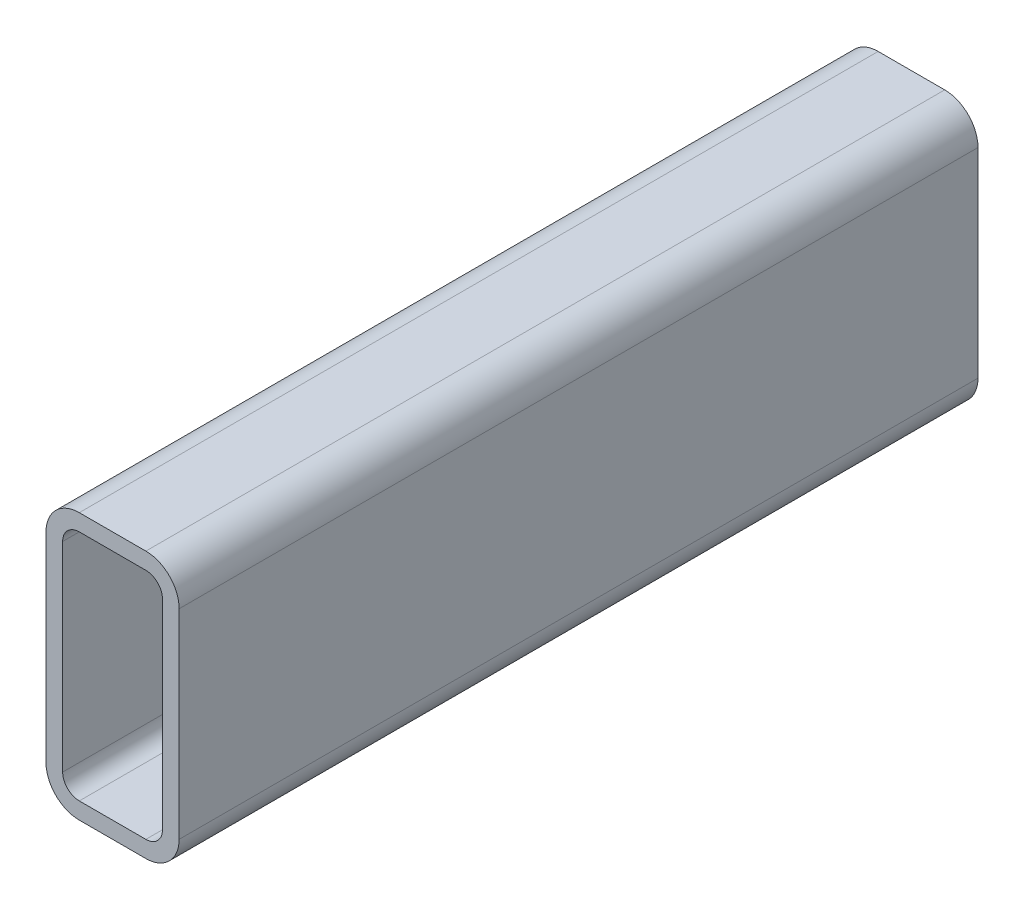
ISO-10303-21;
HEADER;
FILE_DESCRIPTION(('STEP AP214'),'2;1');
FILE_NAME('part.step','',(''),(''),'','','');
FILE_SCHEMA(('AUTOMOTIVE_DESIGN { 1 0 10303 214 1 1 1 1 }'));
ENDSEC;
DATA;
#1=APPLICATION_CONTEXT('core data for automotive mechanical design processes');
#2=APPLICATION_PROTOCOL_DEFINITION('international standard','automotive_design',2000,#1);
#3=PRODUCT_CONTEXT('',#1,'mechanical');
#4=PRODUCT('Part','Part','',(#3));
#5=PRODUCT_RELATED_PRODUCT_CATEGORY('part','',(#4));
#6=PRODUCT_DEFINITION_FORMATION('','',#4);
#7=PRODUCT_DEFINITION_CONTEXT('part definition',#1,'design');
#8=PRODUCT_DEFINITION('design','',#6,#7);
#9=PRODUCT_DEFINITION_SHAPE('','',#8);
#10=(LENGTH_UNIT() NAMED_UNIT(*) SI_UNIT(.MILLI.,.METRE.));
#11=(NAMED_UNIT(*) PLANE_ANGLE_UNIT() SI_UNIT($,.RADIAN.));
#12=(NAMED_UNIT(*) SI_UNIT($,.STERADIAN.) SOLID_ANGLE_UNIT());
#13=UNCERTAINTY_MEASURE_WITH_UNIT(LENGTH_MEASURE(1.E-05),#10,'distance_accuracy_value','');
#14=(GEOMETRIC_REPRESENTATION_CONTEXT(3) GLOBAL_UNCERTAINTY_ASSIGNED_CONTEXT((#13)) GLOBAL_UNIT_ASSIGNED_CONTEXT((#10,
#11,#12)) REPRESENTATION_CONTEXT('',''));
#15=CARTESIAN_POINT('',(0.,0.,0.));
#16=DIRECTION('',(0.,0.,1.));
#17=DIRECTION('',(1.,0.,0.));
#18=AXIS2_PLACEMENT_3D('',#15,#16,#17);
#19=CARTESIAN_POINT('',(12.7,88.9,304.8));
#20=DIRECTION('',(0.,0.,1.));
#21=DIRECTION('',(1.,0.,0.));
#22=AXIS2_PLACEMENT_3D('',#19,#20,#21);
#23=PLANE('',#22);
#24=CARTESIAN_POINT('',(12.7,88.9,304.8));
#25=DIRECTION('',(0.,0.,1.));
#26=DIRECTION('',(1.,0.,0.));
#27=AXIS2_PLACEMENT_3D('',#24,#25,#26);
#28=CIRCLE('',#27,12.7);
#29=CARTESIAN_POINT('',(12.7,101.6,304.8));
#30=VERTEX_POINT('',#29);
#31=CARTESIAN_POINT('',(0.,88.9,304.8));
#32=VERTEX_POINT('',#31);
#33=EDGE_CURVE('E211',#30,#32,#28,.T.);
#34=ORIENTED_EDGE('',*,*,#33,.T.);
#35=DIRECTION('',(0.,-1.,0.));
#36=VECTOR('',#35,1.);
#37=CARTESIAN_POINT('',(0.,12.7,304.8));
#38=LINE('',#37,#36);
#39=CARTESIAN_POINT('',(0.,12.7,304.8));
#40=VERTEX_POINT('',#39);
#41=EDGE_CURVE('E214',#32,#40,#38,.T.);
#42=ORIENTED_EDGE('',*,*,#41,.T.);
#43=CARTESIAN_POINT('',(12.7,12.7,304.8));
#44=DIRECTION('',(0.,0.,1.));
#45=DIRECTION('',(1.,0.,0.));
#46=AXIS2_PLACEMENT_3D('',#43,#44,#45);
#47=CIRCLE('',#46,12.7);
#48=CARTESIAN_POINT('',(12.7,0.,304.8));
#49=VERTEX_POINT('',#48);
#50=EDGE_CURVE('E217',#40,#49,#47,.T.);
#51=ORIENTED_EDGE('',*,*,#50,.T.);
#52=DIRECTION('',(1.,0.,0.));
#53=VECTOR('',#52,1.);
#54=CARTESIAN_POINT('',(38.1,0.,304.8));
#55=LINE('',#54,#53);
#56=CARTESIAN_POINT('',(38.1,0.,304.8));
#57=VERTEX_POINT('',#56);
#58=EDGE_CURVE('E219',#49,#57,#55,.T.);
#59=ORIENTED_EDGE('',*,*,#58,.T.);
#60=CARTESIAN_POINT('',(38.1,12.7,304.8));
#61=DIRECTION('',(0.,0.,1.));
#62=DIRECTION('',(1.,0.,0.));
#63=AXIS2_PLACEMENT_3D('',#60,#61,#62);
#64=CIRCLE('',#63,12.7);
#65=CARTESIAN_POINT('',(50.8,12.7,304.8));
#66=VERTEX_POINT('',#65);
#67=EDGE_CURVE('E221',#57,#66,#64,.T.);
#68=ORIENTED_EDGE('',*,*,#67,.T.);
#69=DIRECTION('',(0.,1.,0.));
#70=VECTOR('',#69,1.);
#71=CARTESIAN_POINT('',(50.8,88.9,304.8));
#72=LINE('',#71,#70);
#73=CARTESIAN_POINT('',(50.8,88.9,304.8));
#74=VERTEX_POINT('',#73);
#75=EDGE_CURVE('E223',#66,#74,#72,.T.);
#76=ORIENTED_EDGE('',*,*,#75,.T.);
#77=CARTESIAN_POINT('',(38.1,88.9,304.8));
#78=DIRECTION('',(0.,0.,1.));
#79=DIRECTION('',(1.,0.,0.));
#80=AXIS2_PLACEMENT_3D('',#77,#78,#79);
#81=CIRCLE('',#80,12.7);
#82=CARTESIAN_POINT('',(38.1,101.6,304.8));
#83=VERTEX_POINT('',#82);
#84=EDGE_CURVE('E225',#74,#83,#81,.T.);
#85=ORIENTED_EDGE('',*,*,#84,.T.);
#86=DIRECTION('',(-1.,0.,0.));
#87=VECTOR('',#86,1.);
#88=CARTESIAN_POINT('',(12.7,101.6,304.8));
#89=LINE('',#88,#87);
#90=EDGE_CURVE('E227',#83,#30,#89,.T.);
#91=ORIENTED_EDGE('',*,*,#90,.T.);
#92=EDGE_LOOP('',(#34,#42,#51,#59,#68,#76,#85,#91));
#93=FACE_BOUND('',#92,.T.);
#94=DIRECTION('',(0.,-1.,0.));
#95=VECTOR('',#94,1.);
#96=CARTESIAN_POINT('',(6.35,12.7,304.8));
#97=LINE('',#96,#95);
#98=CARTESIAN_POINT('',(6.35,88.9,304.8));
#99=VERTEX_POINT('',#98);
#100=CARTESIAN_POINT('',(6.35,12.7,304.8));
#101=VERTEX_POINT('',#100);
#102=EDGE_CURVE('E154',#99,#101,#97,.T.);
#103=ORIENTED_EDGE('',*,*,#102,.F.);
#104=CARTESIAN_POINT('',(12.7,88.9,304.8));
#105=DIRECTION('',(0.,0.,1.));
#106=DIRECTION('',(1.,0.,0.));
#107=AXIS2_PLACEMENT_3D('',#104,#105,#106);
#108=CIRCLE('',#107,6.35);
#109=CARTESIAN_POINT('',(12.7,95.25,304.8));
#110=VERTEX_POINT('',#109);
#111=EDGE_CURVE('E146',#110,#99,#108,.T.);
#112=ORIENTED_EDGE('',*,*,#111,.F.);
#113=DIRECTION('',(-1.,0.,0.));
#114=VECTOR('',#113,1.);
#115=CARTESIAN_POINT('',(12.7,95.25,304.8));
#116=LINE('',#115,#114);
#117=CARTESIAN_POINT('',(38.1,95.25,304.8));
#118=VERTEX_POINT('',#117);
#119=EDGE_CURVE('E179',#118,#110,#116,.T.);
#120=ORIENTED_EDGE('',*,*,#119,.F.);
#121=CARTESIAN_POINT('',(38.1,88.9,304.8));
#122=DIRECTION('',(0.,0.,1.));
#123=DIRECTION('',(1.,0.,0.));
#124=AXIS2_PLACEMENT_3D('',#121,#122,#123);
#125=CIRCLE('',#124,6.35);
#126=CARTESIAN_POINT('',(44.45,88.9,304.8));
#127=VERTEX_POINT('',#126);
#128=EDGE_CURVE('E177',#127,#118,#125,.T.);
#129=ORIENTED_EDGE('',*,*,#128,.F.);
#130=DIRECTION('',(0.,1.,0.));
#131=VECTOR('',#130,1.);
#132=CARTESIAN_POINT('',(44.45,88.9,304.8));
#133=LINE('',#132,#131);
#134=CARTESIAN_POINT('',(44.45,12.7,304.8));
#135=VERTEX_POINT('',#134);
#136=EDGE_CURVE('E175',#135,#127,#133,.T.);
#137=ORIENTED_EDGE('',*,*,#136,.F.);
#138=CARTESIAN_POINT('',(38.1,12.7,304.8));
#139=DIRECTION('',(0.,0.,1.));
#140=DIRECTION('',(1.,0.,0.));
#141=AXIS2_PLACEMENT_3D('',#138,#139,#140);
#142=CIRCLE('',#141,6.35);
#143=CARTESIAN_POINT('',(38.1,6.35,304.8));
#144=VERTEX_POINT('',#143);
#145=EDGE_CURVE('E173',#144,#135,#142,.T.);
#146=ORIENTED_EDGE('',*,*,#145,.F.);
#147=DIRECTION('',(1.,0.,0.));
#148=VECTOR('',#147,1.);
#149=CARTESIAN_POINT('',(38.1,6.35,304.8));
#150=LINE('',#149,#148);
#151=CARTESIAN_POINT('',(12.7,6.35,304.8));
#152=VERTEX_POINT('',#151);
#153=EDGE_CURVE('E169',#152,#144,#150,.T.);
#154=ORIENTED_EDGE('',*,*,#153,.F.);
#155=CARTESIAN_POINT('',(12.7,12.7,304.8));
#156=DIRECTION('',(0.,0.,1.));
#157=DIRECTION('',(1.,0.,0.));
#158=AXIS2_PLACEMENT_3D('',#155,#156,#157);
#159=CIRCLE('',#158,6.35);
#160=EDGE_CURVE('E167',#101,#152,#159,.T.);
#161=ORIENTED_EDGE('',*,*,#160,.F.);
#162=EDGE_LOOP('',(#103,#112,#120,#129,#137,#146,#154,#161));
#163=FACE_BOUND('',#162,.T.);
#164=ADVANCED_FACE('F33',(#93,#163),#23,.T.);
#165=CARTESIAN_POINT('',(12.7,88.9,0.));
#166=DIRECTION('',(0.,0.,1.));
#167=DIRECTION('',(1.,0.,0.));
#168=AXIS2_PLACEMENT_3D('',#165,#166,#167);
#169=PLANE('',#168);
#170=CARTESIAN_POINT('',(12.7,88.9,0.));
#171=DIRECTION('',(0.,0.,1.));
#172=DIRECTION('',(1.,0.,0.));
#173=AXIS2_PLACEMENT_3D('',#170,#171,#172);
#174=CIRCLE('',#173,12.7);
#175=CARTESIAN_POINT('',(12.7,101.6,0.));
#176=VERTEX_POINT('',#175);
#177=CARTESIAN_POINT('',(0.,88.9,0.));
#178=VERTEX_POINT('',#177);
#179=EDGE_CURVE('E162',#176,#178,#174,.T.);
#180=ORIENTED_EDGE('',*,*,#179,.F.);
#181=DIRECTION('',(-1.,0.,0.));
#182=VECTOR('',#181,1.);
#183=CARTESIAN_POINT('',(12.7,101.6,0.));
#184=LINE('',#183,#182);
#185=CARTESIAN_POINT('',(38.1,101.6,0.));
#186=VERTEX_POINT('',#185);
#187=EDGE_CURVE('E215',#186,#176,#184,.T.);
#188=ORIENTED_EDGE('',*,*,#187,.F.);
#189=CARTESIAN_POINT('',(38.1,88.9,0.));
#190=DIRECTION('',(0.,0.,1.));
#191=DIRECTION('',(1.,0.,0.));
#192=AXIS2_PLACEMENT_3D('',#189,#190,#191);
#193=CIRCLE('',#192,12.7);
#194=CARTESIAN_POINT('',(50.8,88.9,0.));
#195=VERTEX_POINT('',#194);
#196=EDGE_CURVE('E242',#195,#186,#193,.T.);
#197=ORIENTED_EDGE('',*,*,#196,.F.);
#198=DIRECTION('',(0.,1.,0.));
#199=VECTOR('',#198,1.);
#200=CARTESIAN_POINT('',(50.8,88.9,0.));
#201=LINE('',#200,#199);
#202=CARTESIAN_POINT('',(50.8,12.7,0.));
#203=VERTEX_POINT('',#202);
#204=EDGE_CURVE('E240',#203,#195,#201,.T.);
#205=ORIENTED_EDGE('',*,*,#204,.F.);
#206=CARTESIAN_POINT('',(38.1,12.7,0.));
#207=DIRECTION('',(0.,0.,1.));
#208=DIRECTION('',(1.,0.,0.));
#209=AXIS2_PLACEMENT_3D('',#206,#207,#208);
#210=CIRCLE('',#209,12.7);
#211=CARTESIAN_POINT('',(38.1,0.,0.));
#212=VERTEX_POINT('',#211);
#213=EDGE_CURVE('E238',#212,#203,#210,.T.);
#214=ORIENTED_EDGE('',*,*,#213,.F.);
#215=DIRECTION('',(1.,0.,0.));
#216=VECTOR('',#215,1.);
#217=CARTESIAN_POINT('',(38.1,0.,0.));
#218=LINE('',#217,#216);
#219=CARTESIAN_POINT('',(12.7,0.,0.));
#220=VERTEX_POINT('',#219);
#221=EDGE_CURVE('E236',#220,#212,#218,.T.);
#222=ORIENTED_EDGE('',*,*,#221,.F.);
#223=CARTESIAN_POINT('',(12.7,12.7,0.));
#224=DIRECTION('',(0.,0.,1.));
#225=DIRECTION('',(1.,0.,0.));
#226=AXIS2_PLACEMENT_3D('',#223,#224,#225);
#227=CIRCLE('',#226,12.7);
#228=CARTESIAN_POINT('',(0.,12.7,0.));
#229=VERTEX_POINT('',#228);
#230=EDGE_CURVE('E234',#229,#220,#227,.T.);
#231=ORIENTED_EDGE('',*,*,#230,.F.);
#232=DIRECTION('',(0.,-1.,0.));
#233=VECTOR('',#232,1.);
#234=CARTESIAN_POINT('',(0.,12.7,0.));
#235=LINE('',#234,#233);
#236=EDGE_CURVE('E232',#178,#229,#235,.T.);
#237=ORIENTED_EDGE('',*,*,#236,.F.);
#238=EDGE_LOOP('',(#180,#188,#197,#205,#214,#222,#231,#237));
#239=FACE_BOUND('',#238,.T.);
#240=CARTESIAN_POINT('',(12.7,88.9,0.));
#241=DIRECTION('',(0.,0.,1.));
#242=DIRECTION('',(1.,0.,0.));
#243=AXIS2_PLACEMENT_3D('',#240,#241,#242);
#244=CIRCLE('',#243,6.35);
#245=CARTESIAN_POINT('',(12.7,95.25,0.));
#246=VERTEX_POINT('',#245);
#247=CARTESIAN_POINT('',(6.35,88.9,0.));
#248=VERTEX_POINT('',#247);
#249=EDGE_CURVE('E56',#246,#248,#244,.T.);
#250=ORIENTED_EDGE('',*,*,#249,.T.);
#251=DIRECTION('',(0.,-1.,0.));
#252=VECTOR('',#251,1.);
#253=CARTESIAN_POINT('',(6.35,12.7,0.));
#254=LINE('',#253,#252);
#255=CARTESIAN_POINT('',(6.35,12.7,0.));
#256=VERTEX_POINT('',#255);
#257=EDGE_CURVE('E161',#248,#256,#254,.T.);
#258=ORIENTED_EDGE('',*,*,#257,.T.);
#259=CARTESIAN_POINT('',(12.7,12.7,0.));
#260=DIRECTION('',(0.,0.,1.));
#261=DIRECTION('',(1.,0.,0.));
#262=AXIS2_PLACEMENT_3D('',#259,#260,#261);
#263=CIRCLE('',#262,6.35);
#264=CARTESIAN_POINT('',(12.7,6.35,0.));
#265=VERTEX_POINT('',#264);
#266=EDGE_CURVE('E183',#256,#265,#263,.T.);
#267=ORIENTED_EDGE('',*,*,#266,.T.);
#268=DIRECTION('',(1.,0.,0.));
#269=VECTOR('',#268,1.);
#270=CARTESIAN_POINT('',(38.1,6.35,0.));
#271=LINE('',#270,#269);
#272=CARTESIAN_POINT('',(38.1,6.35,0.));
#273=VERTEX_POINT('',#272);
#274=EDGE_CURVE('E186',#265,#273,#271,.T.);
#275=ORIENTED_EDGE('',*,*,#274,.T.);
#276=CARTESIAN_POINT('',(38.1,12.7,0.));
#277=DIRECTION('',(0.,0.,1.));
#278=DIRECTION('',(1.,0.,0.));
#279=AXIS2_PLACEMENT_3D('',#276,#277,#278);
#280=CIRCLE('',#279,6.35);
#281=CARTESIAN_POINT('',(44.45,12.7,0.));
#282=VERTEX_POINT('',#281);
#283=EDGE_CURVE('E189',#273,#282,#280,.T.);
#284=ORIENTED_EDGE('',*,*,#283,.T.);
#285=DIRECTION('',(0.,1.,0.));
#286=VECTOR('',#285,1.);
#287=CARTESIAN_POINT('',(44.45,88.9,0.));
#288=LINE('',#287,#286);
#289=CARTESIAN_POINT('',(44.45,88.9,0.));
#290=VERTEX_POINT('',#289);
#291=EDGE_CURVE('E192',#282,#290,#288,.T.);
#292=ORIENTED_EDGE('',*,*,#291,.T.);
#293=CARTESIAN_POINT('',(38.1,88.9,0.));
#294=DIRECTION('',(0.,0.,1.));
#295=DIRECTION('',(1.,0.,0.));
#296=AXIS2_PLACEMENT_3D('',#293,#294,#295);
#297=CIRCLE('',#296,6.35);
#298=CARTESIAN_POINT('',(38.1,95.25,0.));
#299=VERTEX_POINT('',#298);
#300=EDGE_CURVE('E195',#290,#299,#297,.T.);
#301=ORIENTED_EDGE('',*,*,#300,.T.);
#302=DIRECTION('',(-1.,0.,0.));
#303=VECTOR('',#302,1.);
#304=CARTESIAN_POINT('',(12.7,95.25,0.));
#305=LINE('',#304,#303);
#306=EDGE_CURVE('E155',#299,#246,#305,.T.);
#307=ORIENTED_EDGE('',*,*,#306,.T.);
#308=EDGE_LOOP('',(#250,#258,#267,#275,#284,#292,#301,#307));
#309=FACE_BOUND('',#308,.T.);
#310=ADVANCED_FACE('F272',(#239,#309),#169,.F.);
#311=CARTESIAN_POINT('',(12.7,88.9,304.8));
#312=DIRECTION('',(0.,0.,-1.));
#313=DIRECTION('',(-1.,0.,0.));
#314=AXIS2_PLACEMENT_3D('',#311,#312,#313);
#315=CYLINDRICAL_SURFACE('',#314,12.7);
#316=ORIENTED_EDGE('',*,*,#179,.T.);
#317=DIRECTION('',(0.,0.,-1.));
#318=VECTOR('',#317,1.);
#319=CARTESIAN_POINT('',(0.,88.9,304.8));
#320=LINE('',#319,#318);
#321=EDGE_CURVE('E11',#32,#178,#320,.T.);
#322=ORIENTED_EDGE('',*,*,#321,.F.);
#323=ORIENTED_EDGE('',*,*,#33,.F.);
#324=DIRECTION('',(0.,0.,-1.));
#325=VECTOR('',#324,1.);
#326=CARTESIAN_POINT('',(12.7,101.6,304.8));
#327=LINE('',#326,#325);
#328=EDGE_CURVE('E229',#30,#176,#327,.T.);
#329=ORIENTED_EDGE('',*,*,#328,.T.);
#330=EDGE_LOOP('',(#316,#322,#323,#329));
#331=FACE_BOUND('',#330,.T.);
#332=ADVANCED_FACE('F35',(#331),#315,.T.);
#333=CARTESIAN_POINT('',(0.,12.7,304.8));
#334=DIRECTION('',(1.,0.,0.));
#335=DIRECTION('',(0.,0.,-1.));
#336=AXIS2_PLACEMENT_3D('',#333,#334,#335);
#337=PLANE('',#336);
#338=ORIENTED_EDGE('',*,*,#236,.T.);
#339=DIRECTION('',(0.,0.,-1.));
#340=VECTOR('',#339,1.);
#341=CARTESIAN_POINT('',(0.,12.7,304.8));
#342=LINE('',#341,#340);
#343=EDGE_CURVE('E41',#40,#229,#342,.T.);
#344=ORIENTED_EDGE('',*,*,#343,.F.);
#345=ORIENTED_EDGE('',*,*,#41,.F.);
#346=ORIENTED_EDGE('',*,*,#321,.T.);
#347=EDGE_LOOP('',(#338,#344,#345,#346));
#348=FACE_BOUND('',#347,.T.);
#349=ADVANCED_FACE('F289',(#348),#337,.F.);
#350=CARTESIAN_POINT('',(12.7,12.7,304.8));
#351=DIRECTION('',(0.,0.,-1.));
#352=DIRECTION('',(-1.,0.,0.));
#353=AXIS2_PLACEMENT_3D('',#350,#351,#352);
#354=CYLINDRICAL_SURFACE('',#353,12.7);
#355=ORIENTED_EDGE('',*,*,#230,.T.);
#356=DIRECTION('',(0.,0.,-1.));
#357=VECTOR('',#356,1.);
#358=CARTESIAN_POINT('',(12.7,0.,304.8));
#359=LINE('',#358,#357);
#360=EDGE_CURVE('E259',#49,#220,#359,.T.);
#361=ORIENTED_EDGE('',*,*,#360,.F.);
#362=ORIENTED_EDGE('',*,*,#50,.F.);
#363=ORIENTED_EDGE('',*,*,#343,.T.);
#364=EDGE_LOOP('',(#355,#361,#362,#363));
#365=FACE_BOUND('',#364,.T.);
#366=ADVANCED_FACE('F266',(#365),#354,.T.);
#367=CARTESIAN_POINT('',(38.1,0.,304.8));
#368=DIRECTION('',(0.,1.,0.));
#369=DIRECTION('',(0.,0.,1.));
#370=AXIS2_PLACEMENT_3D('',#367,#368,#369);
#371=PLANE('',#370);
#372=ORIENTED_EDGE('',*,*,#221,.T.);
#373=DIRECTION('',(0.,0.,-1.));
#374=VECTOR('',#373,1.);
#375=CARTESIAN_POINT('',(38.1,0.,304.8));
#376=LINE('',#375,#374);
#377=EDGE_CURVE('E256',#57,#212,#376,.T.);
#378=ORIENTED_EDGE('',*,*,#377,.F.);
#379=ORIENTED_EDGE('',*,*,#58,.F.);
#380=ORIENTED_EDGE('',*,*,#360,.T.);
#381=EDGE_LOOP('',(#372,#378,#379,#380));
#382=FACE_BOUND('',#381,.T.);
#383=ADVANCED_FACE('F278',(#382),#371,.F.);
#384=CARTESIAN_POINT('',(38.1,12.7,304.8));
#385=DIRECTION('',(0.,0.,-1.));
#386=DIRECTION('',(-1.,0.,0.));
#387=AXIS2_PLACEMENT_3D('',#384,#385,#386);
#388=CYLINDRICAL_SURFACE('',#387,12.7);
#389=ORIENTED_EDGE('',*,*,#213,.T.);
#390=DIRECTION('',(0.,0.,-1.));
#391=VECTOR('',#390,1.);
#392=CARTESIAN_POINT('',(50.8,12.7,304.8));
#393=LINE('',#392,#391);
#394=EDGE_CURVE('E253',#66,#203,#393,.T.);
#395=ORIENTED_EDGE('',*,*,#394,.F.);
#396=ORIENTED_EDGE('',*,*,#67,.F.);
#397=ORIENTED_EDGE('',*,*,#377,.T.);
#398=EDGE_LOOP('',(#389,#395,#396,#397));
#399=FACE_BOUND('',#398,.T.);
#400=ADVANCED_FACE('F282',(#399),#388,.T.);
#401=CARTESIAN_POINT('',(50.8,88.9,304.8));
#402=DIRECTION('',(-1.,0.,0.));
#403=DIRECTION('',(0.,0.,1.));
#404=AXIS2_PLACEMENT_3D('',#401,#402,#403);
#405=PLANE('',#404);
#406=ORIENTED_EDGE('',*,*,#204,.T.);
#407=DIRECTION('',(0.,0.,-1.));
#408=VECTOR('',#407,1.);
#409=CARTESIAN_POINT('',(50.8,88.9,304.8));
#410=LINE('',#409,#408);
#411=EDGE_CURVE('E250',#74,#195,#410,.T.);
#412=ORIENTED_EDGE('',*,*,#411,.F.);
#413=ORIENTED_EDGE('',*,*,#75,.F.);
#414=ORIENTED_EDGE('',*,*,#394,.T.);
#415=EDGE_LOOP('',(#406,#412,#413,#414));
#416=FACE_BOUND('',#415,.T.);
#417=ADVANCED_FACE('F302',(#416),#405,.F.);
#418=CARTESIAN_POINT('',(38.1,88.9,304.8));
#419=DIRECTION('',(0.,0.,-1.));
#420=DIRECTION('',(-1.,0.,0.));
#421=AXIS2_PLACEMENT_3D('',#418,#419,#420);
#422=CYLINDRICAL_SURFACE('',#421,12.7);
#423=ORIENTED_EDGE('',*,*,#196,.T.);
#424=DIRECTION('',(0.,0.,-1.));
#425=VECTOR('',#424,1.);
#426=CARTESIAN_POINT('',(38.1,101.6,304.8));
#427=LINE('',#426,#425);
#428=EDGE_CURVE('E247',#83,#186,#427,.T.);
#429=ORIENTED_EDGE('',*,*,#428,.F.);
#430=ORIENTED_EDGE('',*,*,#84,.F.);
#431=ORIENTED_EDGE('',*,*,#411,.T.);
#432=EDGE_LOOP('',(#423,#429,#430,#431));
#433=FACE_BOUND('',#432,.T.);
#434=ADVANCED_FACE('F300',(#433),#422,.T.);
#435=CARTESIAN_POINT('',(12.7,101.6,304.8));
#436=DIRECTION('',(0.,-1.,0.));
#437=DIRECTION('',(0.,0.,-1.));
#438=AXIS2_PLACEMENT_3D('',#435,#436,#437);
#439=PLANE('',#438);
#440=ORIENTED_EDGE('',*,*,#187,.T.);
#441=ORIENTED_EDGE('',*,*,#328,.F.);
#442=ORIENTED_EDGE('',*,*,#90,.F.);
#443=ORIENTED_EDGE('',*,*,#428,.T.);
#444=EDGE_LOOP('',(#440,#441,#442,#443));
#445=FACE_BOUND('',#444,.T.);
#446=ADVANCED_FACE('F295',(#445),#439,.F.);
#447=CARTESIAN_POINT('',(12.7,88.9,304.8));
#448=DIRECTION('',(0.,0.,-1.));
#449=DIRECTION('',(-1.,0.,0.));
#450=AXIS2_PLACEMENT_3D('',#447,#448,#449);
#451=CYLINDRICAL_SURFACE('',#450,6.35);
#452=ORIENTED_EDGE('',*,*,#249,.F.);
#453=DIRECTION('',(0.,0.,-1.));
#454=VECTOR('',#453,1.);
#455=CARTESIAN_POINT('',(12.7,95.25,304.8));
#456=LINE('',#455,#454);
#457=EDGE_CURVE('E150',#110,#246,#456,.T.);
#458=ORIENTED_EDGE('',*,*,#457,.F.);
#459=ORIENTED_EDGE('',*,*,#111,.T.);
#460=DIRECTION('',(0.,0.,-1.));
#461=VECTOR('',#460,1.);
#462=CARTESIAN_POINT('',(6.35,88.9,304.8));
#463=LINE('',#462,#461);
#464=EDGE_CURVE('E149',#99,#248,#463,.T.);
#465=ORIENTED_EDGE('',*,*,#464,.T.);
#466=EDGE_LOOP('',(#452,#458,#459,#465));
#467=FACE_BOUND('',#466,.T.);
#468=ADVANCED_FACE('F148',(#467),#451,.F.);
#469=CARTESIAN_POINT('',(6.35,12.7,304.8));
#470=DIRECTION('',(1.,0.,0.));
#471=DIRECTION('',(0.,0.,-1.));
#472=AXIS2_PLACEMENT_3D('',#469,#470,#471);
#473=PLANE('',#472);
#474=ORIENTED_EDGE('',*,*,#257,.F.);
#475=ORIENTED_EDGE('',*,*,#464,.F.);
#476=ORIENTED_EDGE('',*,*,#102,.T.);
#477=DIRECTION('',(0.,0.,-1.));
#478=VECTOR('',#477,1.);
#479=CARTESIAN_POINT('',(6.35,12.7,304.8));
#480=LINE('',#479,#478);
#481=EDGE_CURVE('E163',#101,#256,#480,.T.);
#482=ORIENTED_EDGE('',*,*,#481,.T.);
#483=EDGE_LOOP('',(#474,#475,#476,#482));
#484=FACE_BOUND('',#483,.T.);
#485=ADVANCED_FACE('F158',(#484),#473,.T.);
#486=CARTESIAN_POINT('',(12.7,12.7,304.8));
#487=DIRECTION('',(0.,0.,-1.));
#488=DIRECTION('',(-1.,0.,0.));
#489=AXIS2_PLACEMENT_3D('',#486,#487,#488);
#490=CYLINDRICAL_SURFACE('',#489,6.35);
#491=ORIENTED_EDGE('',*,*,#266,.F.);
#492=ORIENTED_EDGE('',*,*,#481,.F.);
#493=ORIENTED_EDGE('',*,*,#160,.T.);
#494=DIRECTION('',(0.,0.,-1.));
#495=VECTOR('',#494,1.);
#496=CARTESIAN_POINT('',(12.7,6.35,304.8));
#497=LINE('',#496,#495);
#498=EDGE_CURVE('E208',#152,#265,#497,.T.);
#499=ORIENTED_EDGE('',*,*,#498,.T.);
#500=EDGE_LOOP('',(#491,#492,#493,#499));
#501=FACE_BOUND('',#500,.T.);
#502=ADVANCED_FACE('F327',(#501),#490,.F.);
#503=CARTESIAN_POINT('',(38.1,6.35,304.8));
#504=DIRECTION('',(0.,1.,0.));
#505=DIRECTION('',(0.,0.,1.));
#506=AXIS2_PLACEMENT_3D('',#503,#504,#505);
#507=PLANE('',#506);
#508=ORIENTED_EDGE('',*,*,#274,.F.);
#509=ORIENTED_EDGE('',*,*,#498,.F.);
#510=ORIENTED_EDGE('',*,*,#153,.T.);
#511=DIRECTION('',(0.,0.,-1.));
#512=VECTOR('',#511,1.);
#513=CARTESIAN_POINT('',(38.1,6.35,304.8));
#514=LINE('',#513,#512);
#515=EDGE_CURVE('E206',#144,#273,#514,.T.);
#516=ORIENTED_EDGE('',*,*,#515,.T.);
#517=EDGE_LOOP('',(#508,#509,#510,#516));
#518=FACE_BOUND('',#517,.T.);
#519=ADVANCED_FACE('F331',(#518),#507,.T.);
#520=CARTESIAN_POINT('',(38.1,12.7,304.8));
#521=DIRECTION('',(0.,0.,-1.));
#522=DIRECTION('',(-1.,0.,0.));
#523=AXIS2_PLACEMENT_3D('',#520,#521,#522);
#524=CYLINDRICAL_SURFACE('',#523,6.35);
#525=ORIENTED_EDGE('',*,*,#283,.F.);
#526=ORIENTED_EDGE('',*,*,#515,.F.);
#527=ORIENTED_EDGE('',*,*,#145,.T.);
#528=DIRECTION('',(0.,0.,-1.));
#529=VECTOR('',#528,1.);
#530=CARTESIAN_POINT('',(44.45,12.7,304.8));
#531=LINE('',#530,#529);
#532=EDGE_CURVE('E204',#135,#282,#531,.T.);
#533=ORIENTED_EDGE('',*,*,#532,.T.);
#534=EDGE_LOOP('',(#525,#526,#527,#533));
#535=FACE_BOUND('',#534,.T.);
#536=ADVANCED_FACE('F337',(#535),#524,.F.);
#537=CARTESIAN_POINT('',(44.45,88.9,304.8));
#538=DIRECTION('',(-1.,0.,0.));
#539=DIRECTION('',(0.,0.,1.));
#540=AXIS2_PLACEMENT_3D('',#537,#538,#539);
#541=PLANE('',#540);
#542=ORIENTED_EDGE('',*,*,#291,.F.);
#543=ORIENTED_EDGE('',*,*,#532,.F.);
#544=ORIENTED_EDGE('',*,*,#136,.T.);
#545=DIRECTION('',(0.,0.,-1.));
#546=VECTOR('',#545,1.);
#547=CARTESIAN_POINT('',(44.45,88.9,304.8));
#548=LINE('',#547,#546);
#549=EDGE_CURVE('E202',#127,#290,#548,.T.);
#550=ORIENTED_EDGE('',*,*,#549,.T.);
#551=EDGE_LOOP('',(#542,#543,#544,#550));
#552=FACE_BOUND('',#551,.T.);
#553=ADVANCED_FACE('F341',(#552),#541,.T.);
#554=CARTESIAN_POINT('',(38.1,88.9,304.8));
#555=DIRECTION('',(0.,0.,-1.));
#556=DIRECTION('',(-1.,0.,0.));
#557=AXIS2_PLACEMENT_3D('',#554,#555,#556);
#558=CYLINDRICAL_SURFACE('',#557,6.35);
#559=ORIENTED_EDGE('',*,*,#300,.F.);
#560=ORIENTED_EDGE('',*,*,#549,.F.);
#561=ORIENTED_EDGE('',*,*,#128,.T.);
#562=DIRECTION('',(0.,0.,-1.));
#563=VECTOR('',#562,1.);
#564=CARTESIAN_POINT('',(38.1,95.25,304.8));
#565=LINE('',#564,#563);
#566=EDGE_CURVE('E48',#118,#299,#565,.T.);
#567=ORIENTED_EDGE('',*,*,#566,.T.);
#568=EDGE_LOOP('',(#559,#560,#561,#567));
#569=FACE_BOUND('',#568,.T.);
#570=ADVANCED_FACE('F345',(#569),#558,.F.);
#571=CARTESIAN_POINT('',(12.7,95.25,304.8));
#572=DIRECTION('',(0.,-1.,0.));
#573=DIRECTION('',(0.,0.,-1.));
#574=AXIS2_PLACEMENT_3D('',#571,#572,#573);
#575=PLANE('',#574);
#576=ORIENTED_EDGE('',*,*,#306,.F.);
#577=ORIENTED_EDGE('',*,*,#566,.F.);
#578=ORIENTED_EDGE('',*,*,#119,.T.);
#579=ORIENTED_EDGE('',*,*,#457,.T.);
#580=EDGE_LOOP('',(#576,#577,#578,#579));
#581=FACE_BOUND('',#580,.T.);
#582=ADVANCED_FACE('F349',(#581),#575,.T.);
#583=CLOSED_SHELL('',(#164,#310,#332,#349,#366,#383,#400,#417,#434,#446,#468,#485,#502,#519,
#536,#553,#570,#582));
#584=MANIFOLD_SOLID_BREP('B2',#583);
#585=ADVANCED_BREP_SHAPE_REPRESENTATION('',(#18,#584),#14);
#586=SHAPE_DEFINITION_REPRESENTATION(#9,#585);
ENDSEC;
END-ISO-10303-21;
